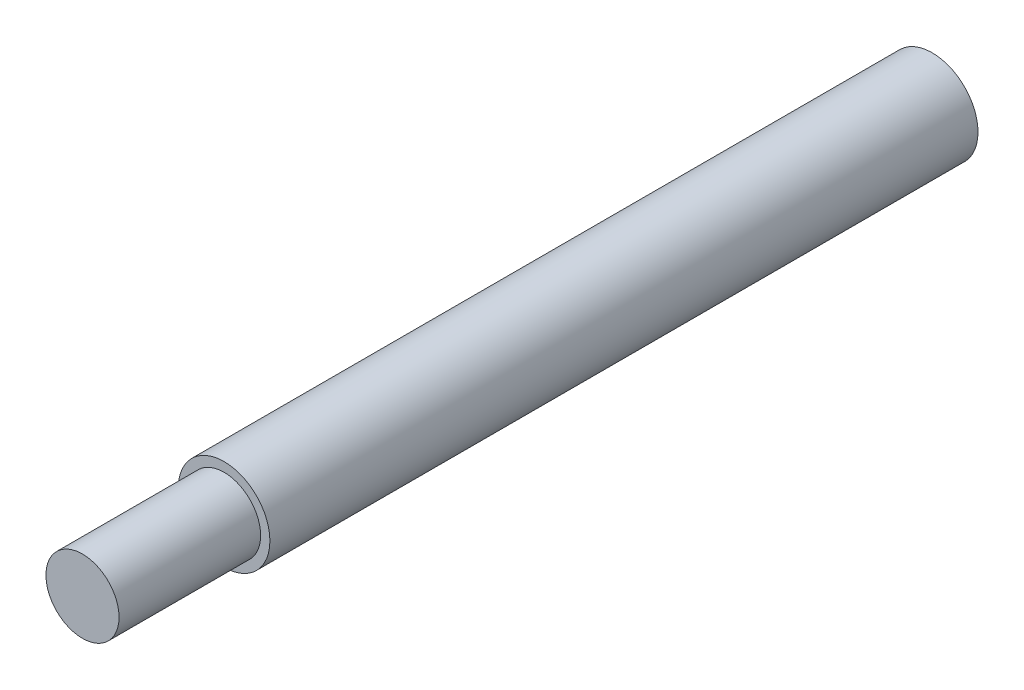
from build123d import *

# Parameters (mm, degrees)
SKETCH1_R           = 10.025
BOSS_EXTRUDE1_DEPTH = 155
SKETCH2_R           = 8
BOSS_EXTRUDE2_DEPTH = 31


with BuildPart() as part:
    # Sketch1 → Boss-Extrude1 (new body)
    with BuildSketch(Plane.XY):
        Circle(SKETCH1_R)
    extrude(amount=BOSS_EXTRUDE1_DEPTH)

    # Sketch2 → Boss-Extrude2 (add)
    with BuildSketch(Plane.XY.offset(155)):
        Circle(SKETCH2_R)
    extrude(amount=BOSS_EXTRUDE2_DEPTH)


solid = part.part
